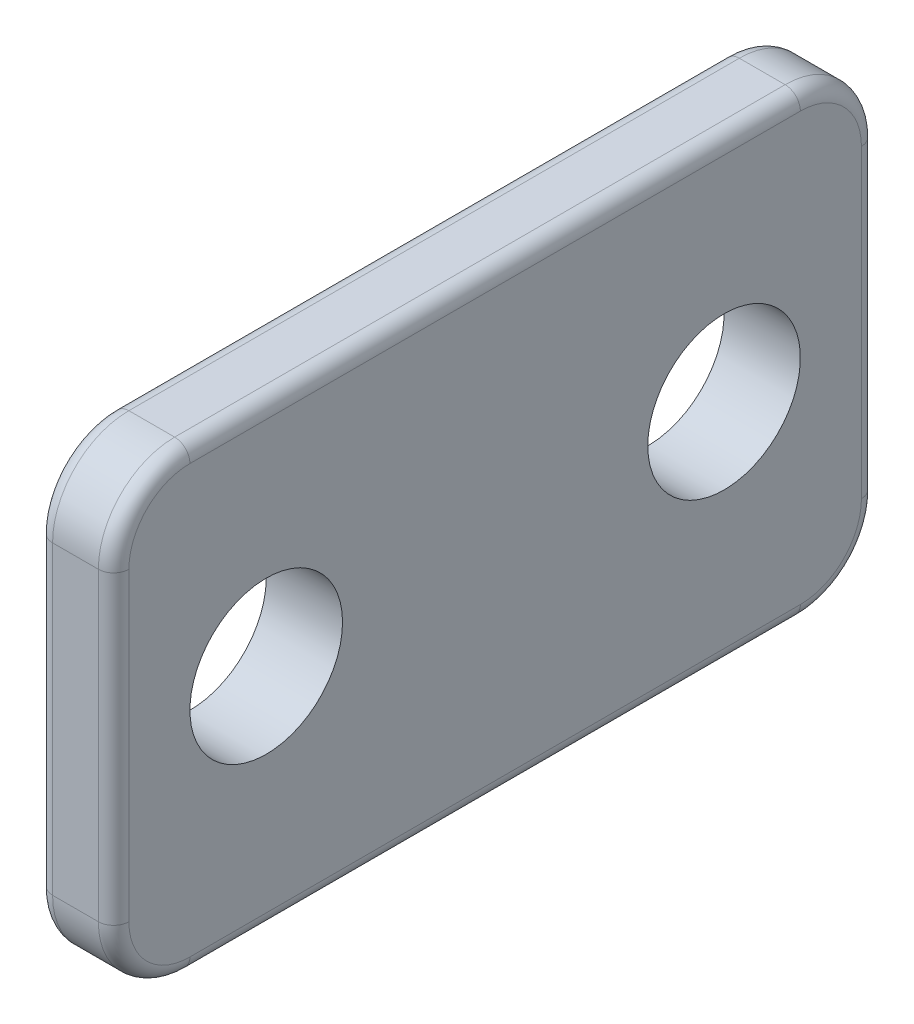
from build123d import *

# Parameters (mm, degrees)
SKETCH1_R           = 5
BOSS_EXTRUDE1_DEPTH = 2.5
FILLET1_R           = 1


with BuildPart() as part:
    # Sketch1 → Boss-Extrude1 (new, symmetric)
    with BuildSketch(Plane(origin=(0, 0, 0), x_dir=(0, 0, -1), z_dir=(1, 0, 0))):
        with BuildLine():
            Line((-20, 15), (20, 15))
            ThreePointArc((20, 15), (23.535533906, 13.535533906), (25, 10))
            Line((25, 10), (25, -10))
            ThreePointArc((25, -10), (23.535533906, -13.535533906), (20, -15))
            Line((20, -15), (-20, -15))
            ThreePointArc((-20, -15), (-23.535533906, -13.535533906), (-25, -10))
            Line((-25, -10), (-25, 10))
            ThreePointArc((-25, 10), (-23.535533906, 13.535533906), (-20, 15))
        make_face()
        with Locations((-15, 0)):
            Circle(SKETCH1_R, mode=Mode.SUBTRACT)
        with Locations(Location((15, 0, 0), (0, 0, 180))):
            Circle(SKETCH1_R, mode=Mode.SUBTRACT)
    extrude(amount=BOSS_EXTRUDE1_DEPTH, both=True)

    # Fillet1
    fillet1_edges = [part.edges().sort_by_distance(p)[0] for p in [
        (2.5, 13.535533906, 23.535533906),
        (-2.5, 15, 0),
        (-2.5, 13.535533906, -23.535533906),
        (2.5, 0, 25),
        (2.5, -13.535533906, 23.535533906),
        (2.5, -15, 0),
        (2.5, -13.535533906, -23.535533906),
        (2.5, 0, -25),
        (2.5, 13.535533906, -23.535533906),
        (2.5, 15, 0),
        (-2.5, 0, -25),
        (-2.5, -13.535533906, -23.535533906),
        (-2.5, -15, 0),
        (-2.5, -13.535533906, 23.535533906),
        (-2.5, 0, 25),
        (-2.5, 13.535533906, 23.535533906),
    ]]
    fillet(fillet1_edges, radius=FILLET1_R)


solid = part.part
